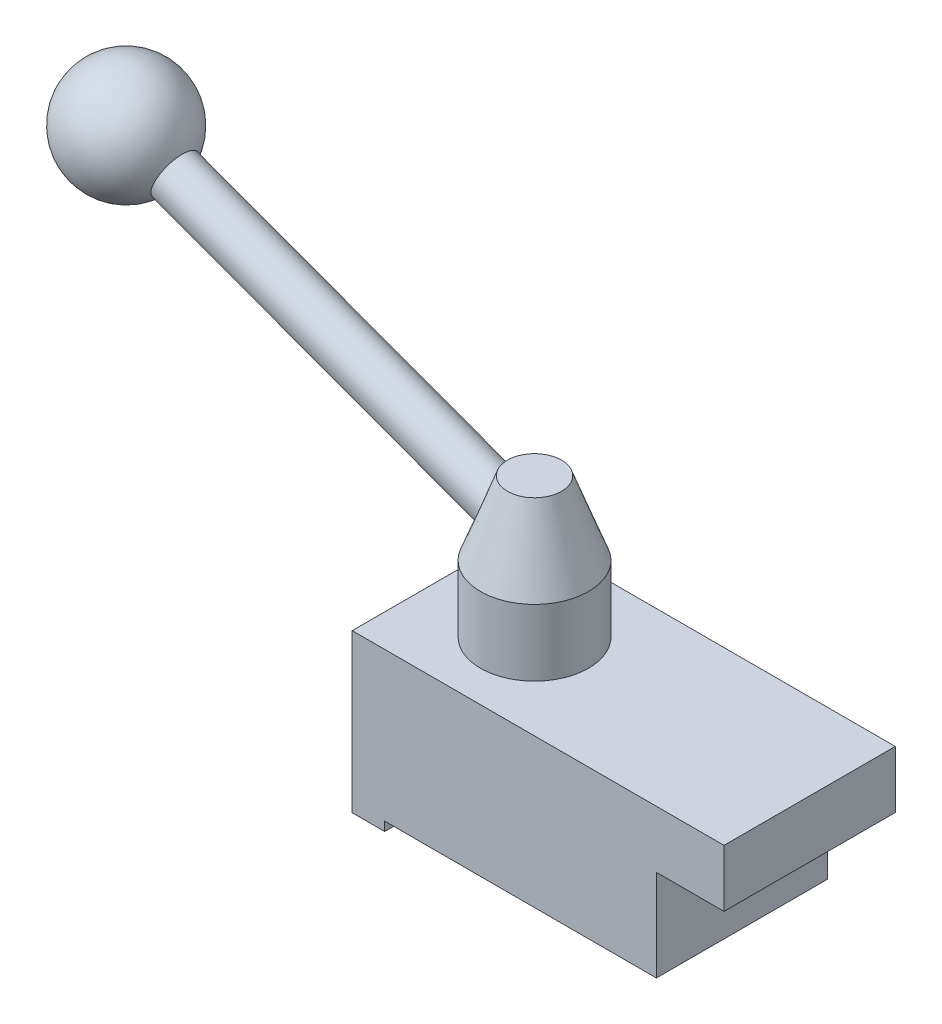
from build123d import *

# Parameters (mm, degrees)
BOSS_EXTRU_1_DEPTH = 19


with BuildPart() as part:
    # Esquisse1 → Boss.-Extru.1 (new, symmetric)
    with BuildSketch(Plane.XY):
        Polygon((-127.5, 0), (-120.290628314, 0), (-120.290628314, 2), (-60, 2), (-60, 22.3), (-45, 22.3), (-45, 35), (-127.5, 35), align=None)
    extrude(amount=BOSS_EXTRU_1_DEPTH, both=True)


with BuildPart() as body_2:
    # Esquisse2 → R_volution1 (revolve)
    with BuildSketch(Plane.XY, mode=Mode.PRIVATE) as r_volution1_sk:
        Polygon((-106.046924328, 35), (-118.046924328, 35), (-118.046924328, 49.745522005), (-112.046924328, 66), (-106.046924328, 66), align=None)
    revolve(r_volution1_sk.sketch.rotate(Axis((-106.046924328, -18.16250418, 0), (0, 1, 0)), 270), axis=Axis((-106.046924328, -18.16250418, 0), (0, 1, 0)))


with BuildPart() as body_3:
    # Esquisse3 → R_volution2 (revolve)
    with BuildSketch(Plane.XY):
        with BuildLine():
            Line((-110.866216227, 56.329540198), (-208.390608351, 92.328626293))
            ThreePointArc((-208.390608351, 92.328626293), (-194.82255141, 100.363616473), (-184.18496392, 88.72338586))
            Line((-184.18496392, 88.72338586), (-109.13476571, 61.020177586))
            Line((-109.13476571, 61.020177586), (-110.866216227, 56.329540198))
        make_face()
    revolve(axis=Axis((-110.866216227, 56.329540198, 0), (-0.9381274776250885, 0.3462901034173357, 0)))


solid = Compound([part.part, body_2.part, body_3.part])
